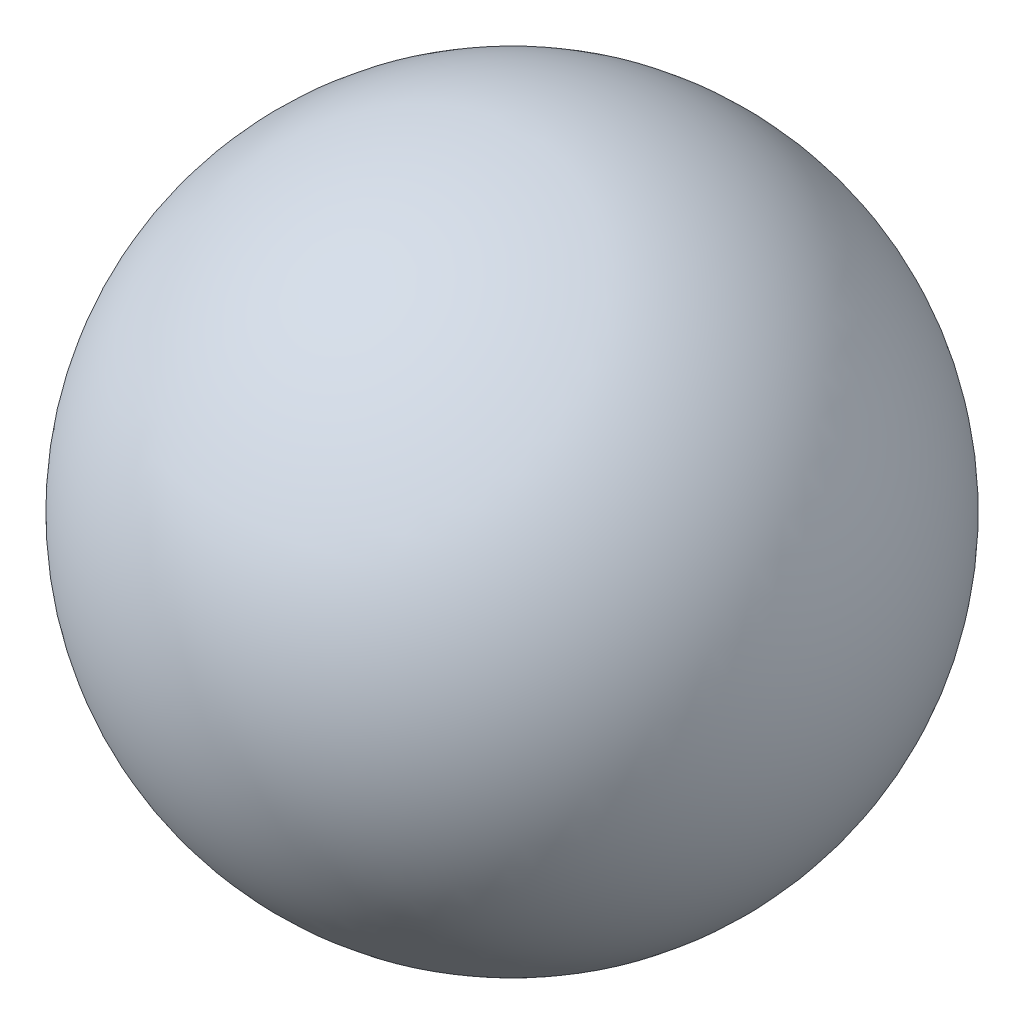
ISO-10303-21;
HEADER;
FILE_DESCRIPTION(('STEP AP214'),'2;1');
FILE_NAME('part.step','',(''),(''),'','','');
FILE_SCHEMA(('AUTOMOTIVE_DESIGN { 1 0 10303 214 1 1 1 1 }'));
ENDSEC;
DATA;
#1=APPLICATION_CONTEXT('core data for automotive mechanical design processes');
#2=APPLICATION_PROTOCOL_DEFINITION('international standard','automotive_design',2000,#1);
#3=PRODUCT_CONTEXT('',#1,'mechanical');
#4=PRODUCT('Part','Part','',(#3));
#5=PRODUCT_RELATED_PRODUCT_CATEGORY('part','',(#4));
#6=PRODUCT_DEFINITION_FORMATION('','',#4);
#7=PRODUCT_DEFINITION_CONTEXT('part definition',#1,'design');
#8=PRODUCT_DEFINITION('design','',#6,#7);
#9=PRODUCT_DEFINITION_SHAPE('','',#8);
#10=(LENGTH_UNIT() NAMED_UNIT(*) SI_UNIT(.MILLI.,.METRE.));
#11=(NAMED_UNIT(*) PLANE_ANGLE_UNIT() SI_UNIT($,.RADIAN.));
#12=(NAMED_UNIT(*) SI_UNIT($,.STERADIAN.) SOLID_ANGLE_UNIT());
#13=UNCERTAINTY_MEASURE_WITH_UNIT(LENGTH_MEASURE(1.E-05),#10,'distance_accuracy_value','');
#14=(GEOMETRIC_REPRESENTATION_CONTEXT(3) GLOBAL_UNCERTAINTY_ASSIGNED_CONTEXT((#13)) GLOBAL_UNIT_ASSIGNED_CONTEXT((#10,
#11,#12)) REPRESENTATION_CONTEXT('',''));
#15=CARTESIAN_POINT('',(0.,0.,0.));
#16=DIRECTION('',(0.,0.,1.));
#17=DIRECTION('',(1.,0.,0.));
#18=AXIS2_PLACEMENT_3D('',#15,#16,#17);
#19=CARTESIAN_POINT('',(130.857582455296,6.71961838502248,0.));
#20=DIRECTION('',(0.,1.,0.));
#21=DIRECTION('',(1.,0.,0.));
#22=AXIS2_PLACEMENT_3D('',#19,#20,#21);
#23=SPHERICAL_SURFACE('',#22,38.8389575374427);
#24=CARTESIAN_POINT('',(130.857582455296,45.5585759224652,0.));
#25=VERTEX_POINT('',#24);
#26=VERTEX_LOOP('',#25);
#27=FACE_BOUND('',#26,.T.);
#28=ADVANCED_FACE('F26',(#27),#23,.T.);
#29=CLOSED_SHELL('',(#28));
#30=MANIFOLD_SOLID_BREP('B2',#29);
#31=ADVANCED_BREP_SHAPE_REPRESENTATION('',(#18,#30),#14);
#32=SHAPE_DEFINITION_REPRESENTATION(#9,#31);
ENDSEC;
END-ISO-10303-21;
